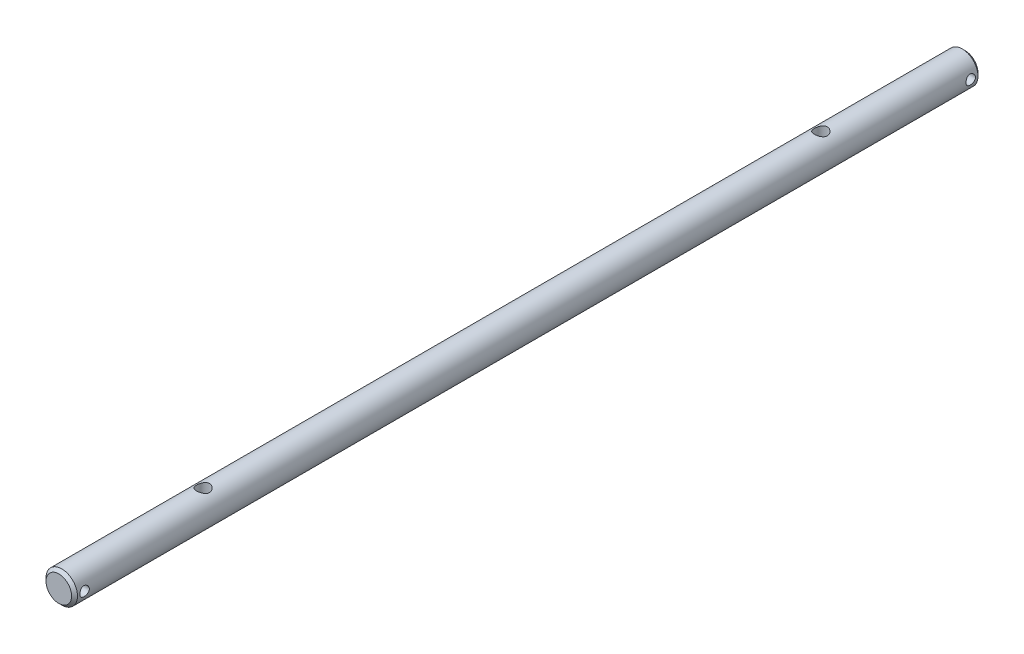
from build123d import *

# Parameters (mm, degrees)
SKETCH1_R                        = 7.9375
ROD_DEPTH                        = 457.2
SPRONG_RETAINER_HOLES_DEPTH      = 458.337783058
SPRONG_RETAINER_HOLES_DEPTH_BACK = 458.337783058
SKETCH2_R                        = 2.38125
DOOR_HOLES_DEPTH                 = 458.337783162
DOOR_HOLES_DEPTH_BACK            = 458.337783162
SKETCH3_R                        = 3.2639


with BuildPart() as part:
    # Sketch1 → rod (new body)
    with BuildSketch(Plane.XY):
        Circle(SKETCH1_R)
    extrude(amount=ROD_DEPTH)

    # Sketch2 → sprong retainer holes (cut, two sides: drawn at the far end of the back side and taken through both)
    with BuildSketch(Plane(origin=(0, 0, 0), x_dir=(0, 0, -1), z_dir=(1, 0, 0)).offset(-SPRONG_RETAINER_HOLES_DEPTH_BACK)):
        with Locations((-5.08, 0.150520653)):
            Circle(SKETCH2_R)
        with Locations((-452.12, 0.150520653)):
            Circle(SKETCH2_R)
    extrude(amount=SPRONG_RETAINER_HOLES_DEPTH + SPRONG_RETAINER_HOLES_DEPTH_BACK, mode=Mode.SUBTRACT)

    # Sketch3 → door holes (cut, two sides: drawn at the far end of the back side and taken through both)
    with BuildSketch(Plane(origin=(0, 0, 0), x_dir=(1, 0, 0), z_dir=(0, 1, 0)).offset(-DOOR_HOLES_DEPTH_BACK)):
        with Locations(Location((0, -72.771, 0), (0, 0, 270))):
            Circle(SKETCH3_R)
        with Locations(Location((0, -384.429, 0), (0, 0, 270))):
            Circle(SKETCH3_R)
    extrude(amount=DOOR_HOLES_DEPTH + DOOR_HOLES_DEPTH_BACK, mode=Mode.SUBTRACT)

    # Sketch4 → Cut-Revolve1 (revolve, cut)
    with BuildSketch(Plane(origin=(0, 0, 0), x_dir=(1, 0, 0), z_dir=(0, 1, 0)), mode=Mode.PRIVATE) as cut_revolve1_sk:
        Polygon((5.085315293, 1.433940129), (8.804345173, -2.285089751), (8.804345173, -454.850699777), (5.085315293, -458.569729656), (8.804345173, -458.569729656), (13.633955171, -458.569729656), (13.633955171, 1.433940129), (12.303309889, 1.433940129), (8.804345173, 1.433940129), align=None)
    revolve(cut_revolve1_sk.sketch.rotate(Axis((0, 0, 0), (0, 0, -1)), 180), axis=Axis((0, 0, 0), (0, 0, -1)), mode=Mode.SUBTRACT)


solid = part.part
